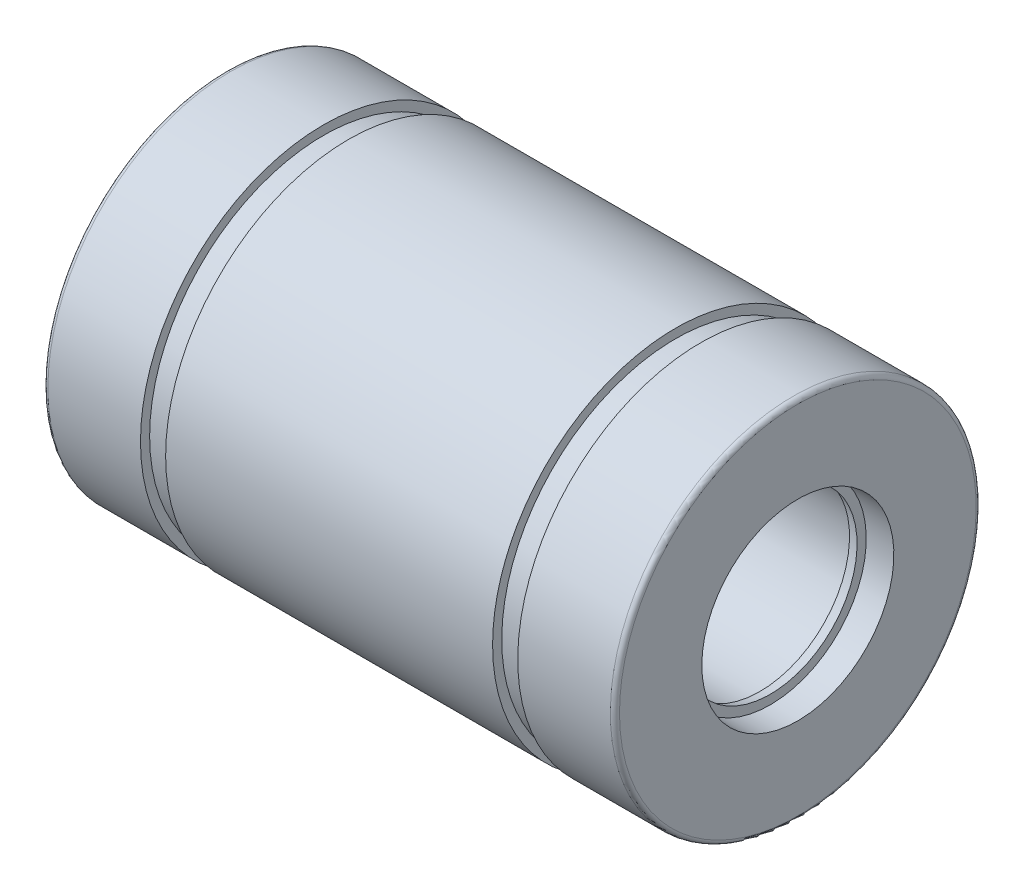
ISO-10303-21;
HEADER;
FILE_DESCRIPTION(('STEP AP214'),'2;1');
FILE_NAME('part.step','',(''),(''),'','','');
FILE_SCHEMA(('AUTOMOTIVE_DESIGN { 1 0 10303 214 1 1 1 1 }'));
ENDSEC;
DATA;
#1=APPLICATION_CONTEXT('core data for automotive mechanical design processes');
#2=APPLICATION_PROTOCOL_DEFINITION('international standard','automotive_design',2000,#1);
#3=PRODUCT_CONTEXT('',#1,'mechanical');
#4=PRODUCT('Part','Part','',(#3));
#5=PRODUCT_RELATED_PRODUCT_CATEGORY('part','',(#4));
#6=PRODUCT_DEFINITION_FORMATION('','',#4);
#7=PRODUCT_DEFINITION_CONTEXT('part definition',#1,'design');
#8=PRODUCT_DEFINITION('design','',#6,#7);
#9=PRODUCT_DEFINITION_SHAPE('','',#8);
#10=(LENGTH_UNIT() NAMED_UNIT(*) SI_UNIT(.MILLI.,.METRE.));
#11=(NAMED_UNIT(*) PLANE_ANGLE_UNIT() SI_UNIT($,.RADIAN.));
#12=(NAMED_UNIT(*) SI_UNIT($,.STERADIAN.) SOLID_ANGLE_UNIT());
#13=UNCERTAINTY_MEASURE_WITH_UNIT(LENGTH_MEASURE(1.E-05),#10,'distance_accuracy_value','');
#14=(GEOMETRIC_REPRESENTATION_CONTEXT(3) GLOBAL_UNCERTAINTY_ASSIGNED_CONTEXT((#13)) GLOBAL_UNIT_ASSIGNED_CONTEXT((#10,
#11,#12)) REPRESENTATION_CONTEXT('',''));
#15=CARTESIAN_POINT('',(0.,0.,0.));
#16=DIRECTION('',(0.,0.,1.));
#17=DIRECTION('',(1.,0.,0.));
#18=AXIS2_PLACEMENT_3D('',#15,#16,#17);
#19=CARTESIAN_POINT('',(0.,0.,-4.));
#20=DIRECTION('',(-1.,0.,0.));
#21=DIRECTION('',(0.,0.,1.));
#22=AXIS2_PLACEMENT_3D('',#19,#20,#21);
#23=PLANE('',#22);
#24=CARTESIAN_POINT('',(0.,0.,0.));
#25=DIRECTION('',(1.,0.,0.));
#26=DIRECTION('',(0.,0.,-1.));
#27=AXIS2_PLACEMENT_3D('',#24,#25,#26);
#28=CIRCLE('',#27,4.2);
#29=CARTESIAN_POINT('',(0.,0.,4.2));
#30=VERTEX_POINT('',#29);
#31=EDGE_CURVE('E217',#30,#30,#28,.T.);
#32=ORIENTED_EDGE('',*,*,#31,.T.);
#33=EDGE_LOOP('',(#32));
#34=FACE_BOUND('',#33,.T.);
#35=CARTESIAN_POINT('',(0.,0.,0.));
#36=DIRECTION('',(-1.,0.,0.));
#37=DIRECTION('',(0.,0.,1.));
#38=AXIS2_PLACEMENT_3D('',#35,#36,#37);
#39=CIRCLE('',#38,7.8);
#40=CARTESIAN_POINT('',(0.,0.,7.8));
#41=VERTEX_POINT('',#40);
#42=CARTESIAN_POINT('',(0.,7.8,0.));
#43=VERTEX_POINT('',#42);
#44=EDGE_CURVE('E362',#41,#43,#39,.T.);
#45=ORIENTED_EDGE('',*,*,#44,.T.);
#46=CARTESIAN_POINT('',(0.,0.,0.));
#47=DIRECTION('',(-1.,0.,0.));
#48=DIRECTION('',(0.,0.,1.));
#49=AXIS2_PLACEMENT_3D('',#46,#47,#48);
#50=CIRCLE('',#49,7.8);
#51=EDGE_CURVE('E364',#43,#41,#50,.T.);
#52=ORIENTED_EDGE('',*,*,#51,.T.);
#53=EDGE_LOOP('',(#45,#52));
#54=FACE_BOUND('',#53,.T.);
#55=ADVANCED_FACE('F16',(#34,#54),#23,.T.);
#56=CARTESIAN_POINT('',(5.35,0.,-7.8));
#57=DIRECTION('',(1.,0.,0.));
#58=DIRECTION('',(0.,1.,0.));
#59=AXIS2_PLACEMENT_3D('',#56,#57,#58);
#60=PLANE('',#59);
#61=CARTESIAN_POINT('',(5.35,0.,0.));
#62=DIRECTION('',(1.,0.,0.));
#63=DIRECTION('',(0.,0.,-1.));
#64=AXIS2_PLACEMENT_3D('',#61,#62,#63);
#65=CIRCLE('',#64,7.6);
#66=CARTESIAN_POINT('',(5.35,0.,7.6));
#67=VERTEX_POINT('',#66);
#68=EDGE_CURVE('E187',#67,#67,#65,.T.);
#69=ORIENTED_EDGE('',*,*,#68,.T.);
#70=EDGE_LOOP('',(#69));
#71=FACE_BOUND('',#70,.T.);
#72=CARTESIAN_POINT('',(5.35,0.,0.));
#73=DIRECTION('',(1.,0.,0.));
#74=DIRECTION('',(0.,0.,-1.));
#75=AXIS2_PLACEMENT_3D('',#72,#73,#74);
#76=CIRCLE('',#75,8.);
#77=CARTESIAN_POINT('',(5.35,0.,8.));
#78=VERTEX_POINT('',#77);
#79=EDGE_CURVE('E401',#78,#78,#76,.T.);
#80=ORIENTED_EDGE('',*,*,#79,.F.);
#81=EDGE_LOOP('',(#80));
#82=FACE_BOUND('',#81,.T.);
#83=ADVANCED_FACE('F188',(#71,#82),#60,.F.);
#84=CARTESIAN_POINT('',(4.25,0.,-7.8));
#85=DIRECTION('',(-1.,0.,0.));
#86=DIRECTION('',(0.,0.,1.));
#87=AXIS2_PLACEMENT_3D('',#84,#85,#86);
#88=PLANE('',#87);
#89=CARTESIAN_POINT('',(4.25,0.,0.));
#90=DIRECTION('',(1.,0.,0.));
#91=DIRECTION('',(0.,0.,-1.));
#92=AXIS2_PLACEMENT_3D('',#89,#90,#91);
#93=CIRCLE('',#92,7.6);
#94=CARTESIAN_POINT('',(4.25,0.,7.6));
#95=VERTEX_POINT('',#94);
#96=EDGE_CURVE('E204',#95,#95,#93,.T.);
#97=ORIENTED_EDGE('',*,*,#96,.F.);
#98=EDGE_LOOP('',(#97));
#99=FACE_BOUND('',#98,.T.);
#100=CARTESIAN_POINT('',(4.25,0.,0.));
#101=DIRECTION('',(-1.,0.,0.));
#102=DIRECTION('',(0.,0.,-1.));
#103=AXIS2_PLACEMENT_3D('',#100,#101,#102);
#104=CIRCLE('',#103,8.);
#105=CARTESIAN_POINT('',(4.25,0.,8.));
#106=VERTEX_POINT('',#105);
#107=EDGE_CURVE('E375',#106,#106,#104,.T.);
#108=ORIENTED_EDGE('',*,*,#107,.F.);
#109=EDGE_LOOP('',(#108));
#110=FACE_BOUND('',#109,.T.);
#111=ADVANCED_FACE('F357',(#99,#110),#88,.F.);
#112=CARTESIAN_POINT('',(1.208,0.,-4.4));
#113=DIRECTION('',(-1.,0.,0.));
#114=DIRECTION('',(0.,0.,1.));
#115=AXIS2_PLACEMENT_3D('',#112,#113,#114);
#116=PLANE('',#115);
#117=CARTESIAN_POINT('',(1.208,0.,0.));
#118=DIRECTION('',(1.,0.,0.));
#119=DIRECTION('',(0.,0.,-1.));
#120=AXIS2_PLACEMENT_3D('',#117,#118,#119);
#121=CIRCLE('',#120,4.2);
#122=CARTESIAN_POINT('',(1.208,0.,4.2));
#123=VERTEX_POINT('',#122);
#124=EDGE_CURVE('E193',#123,#123,#121,.T.);
#125=ORIENTED_EDGE('',*,*,#124,.F.);
#126=EDGE_LOOP('',(#125));
#127=FACE_BOUND('',#126,.T.);
#128=CARTESIAN_POINT('',(1.208,0.,0.));
#129=DIRECTION('',(1.,0.,0.));
#130=DIRECTION('',(0.,0.,-1.));
#131=AXIS2_PLACEMENT_3D('',#128,#129,#130);
#132=CIRCLE('',#131,4.8);
#133=CARTESIAN_POINT('',(1.208,0.,4.8));
#134=VERTEX_POINT('',#133);
#135=EDGE_CURVE('E228',#134,#134,#132,.T.);
#136=ORIENTED_EDGE('',*,*,#135,.T.);
#137=EDGE_LOOP('',(#136));
#138=FACE_BOUND('',#137,.T.);
#139=ADVANCED_FACE('F431',(#127,#138),#116,.F.);
#140=CARTESIAN_POINT('',(1.661,0.,-4.4));
#141=DIRECTION('',(1.,0.,0.));
#142=DIRECTION('',(0.,1.,0.));
#143=AXIS2_PLACEMENT_3D('',#140,#141,#142);
#144=PLANE('',#143);
#145=CARTESIAN_POINT('',(1.661,0.,0.));
#146=DIRECTION('',(-1.,0.,0.));
#147=DIRECTION('',(0.,0.,-1.));
#148=AXIS2_PLACEMENT_3D('',#145,#146,#147);
#149=CIRCLE('',#148,4.);
#150=CARTESIAN_POINT('',(1.661,0.,4.));
#151=VERTEX_POINT('',#150);
#152=EDGE_CURVE('E388',#151,#151,#149,.T.);
#153=ORIENTED_EDGE('',*,*,#152,.F.);
#154=EDGE_LOOP('',(#153));
#155=FACE_BOUND('',#154,.T.);
#156=CARTESIAN_POINT('',(1.661,0.,0.));
#157=DIRECTION('',(1.,0.,0.));
#158=DIRECTION('',(0.,0.,-1.));
#159=AXIS2_PLACEMENT_3D('',#156,#157,#158);
#160=CIRCLE('',#159,4.8);
#161=CARTESIAN_POINT('',(1.661,0.,4.8));
#162=VERTEX_POINT('',#161);
#163=EDGE_CURVE('E290',#162,#162,#160,.T.);
#164=ORIENTED_EDGE('',*,*,#163,.F.);
#165=EDGE_LOOP('',(#164));
#166=FACE_BOUND('',#165,.T.);
#167=ADVANCED_FACE('F816',(#155,#166),#144,.F.);
#168=CARTESIAN_POINT('',(25.,2.,3.46410161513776));
#169=DIRECTION('',(1.,0.,0.));
#170=DIRECTION('',(0.,-1.,0.));
#171=AXIS2_PLACEMENT_3D('',#168,#169,#170);
#172=PLANE('',#171);
#173=CARTESIAN_POINT('',(25.,0.,0.));
#174=DIRECTION('',(-1.,0.,0.));
#175=DIRECTION('',(0.,0.5,0.866025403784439));
#176=AXIS2_PLACEMENT_3D('',#173,#174,#175);
#177=CIRCLE('',#176,4.2);
#178=CARTESIAN_POINT('',(25.,-2.1,-3.63730669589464));
#179=VERTEX_POINT('',#178);
#180=EDGE_CURVE('E276',#179,#179,#177,.T.);
#181=ORIENTED_EDGE('',*,*,#180,.T.);
#182=EDGE_LOOP('',(#181));
#183=FACE_BOUND('',#182,.T.);
#184=CARTESIAN_POINT('',(25.,0.,0.));
#185=DIRECTION('',(1.,0.,0.));
#186=DIRECTION('',(0.,0.,-1.));
#187=AXIS2_PLACEMENT_3D('',#184,#185,#186);
#188=CIRCLE('',#187,7.8);
#189=CARTESIAN_POINT('',(25.,-3.9,-6.75499814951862));
#190=VERTEX_POINT('',#189);
#191=CARTESIAN_POINT('',(25.,6.75499814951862,-3.9));
#192=VERTEX_POINT('',#191);
#193=EDGE_CURVE('E249',#190,#192,#188,.T.);
#194=ORIENTED_EDGE('',*,*,#193,.T.);
#195=CARTESIAN_POINT('',(25.,0.,0.));
#196=DIRECTION('',(1.,0.,0.));
#197=DIRECTION('',(0.,0.,-1.));
#198=AXIS2_PLACEMENT_3D('',#195,#196,#197);
#199=CIRCLE('',#198,7.8);
#200=EDGE_CURVE('E253',#192,#190,#199,.T.);
#201=ORIENTED_EDGE('',*,*,#200,.T.);
#202=EDGE_LOOP('',(#194,#201));
#203=FACE_BOUND('',#202,.T.);
#204=ADVANCED_FACE('F811',(#183,#203),#172,.T.);
#205=CARTESIAN_POINT('',(19.65,3.9,6.75499814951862));
#206=DIRECTION('',(-1.,0.,0.));
#207=DIRECTION('',(0.,0.,1.));
#208=AXIS2_PLACEMENT_3D('',#205,#206,#207);
#209=PLANE('',#208);
#210=CARTESIAN_POINT('',(19.65,0.,0.));
#211=DIRECTION('',(-1.,0.,0.));
#212=DIRECTION('',(0.,0.5,0.866025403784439));
#213=AXIS2_PLACEMENT_3D('',#210,#211,#212);
#214=CIRCLE('',#213,7.6);
#215=CARTESIAN_POINT('',(19.65,-3.8,-6.58179306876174));
#216=VERTEX_POINT('',#215);
#217=EDGE_CURVE('E265',#216,#216,#214,.T.);
#218=ORIENTED_EDGE('',*,*,#217,.T.);
#219=EDGE_LOOP('',(#218));
#220=FACE_BOUND('',#219,.T.);
#221=CARTESIAN_POINT('',(19.65,0.,0.));
#222=DIRECTION('',(-1.,0.,0.));
#223=DIRECTION('',(0.,0.5,0.866025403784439));
#224=AXIS2_PLACEMENT_3D('',#221,#222,#223);
#225=CIRCLE('',#224,8.);
#226=CARTESIAN_POINT('',(19.65,4.,6.92820323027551));
#227=VERTEX_POINT('',#226);
#228=CARTESIAN_POINT('',(19.65,0.,8.));
#229=VERTEX_POINT('',#228);
#230=EDGE_CURVE('E415',#227,#229,#225,.T.);
#231=ORIENTED_EDGE('',*,*,#230,.F.);
#232=CARTESIAN_POINT('',(19.65,0.,0.));
#233=DIRECTION('',(-1.,0.,0.));
#234=DIRECTION('',(0.,0.5,0.866025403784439));
#235=AXIS2_PLACEMENT_3D('',#232,#233,#234);
#236=CIRCLE('',#235,8.);
#237=EDGE_CURVE('E411',#229,#227,#236,.T.);
#238=ORIENTED_EDGE('',*,*,#237,.F.);
#239=EDGE_LOOP('',(#231,#238));
#240=FACE_BOUND('',#239,.T.);
#241=ADVANCED_FACE('F348',(#220,#240),#209,.F.);
#242=CARTESIAN_POINT('',(20.75,3.9,6.75499814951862));
#243=DIRECTION('',(1.,0.,0.));
#244=DIRECTION('',(0.,-1.,0.));
#245=AXIS2_PLACEMENT_3D('',#242,#243,#244);
#246=PLANE('',#245);
#247=CARTESIAN_POINT('',(20.75,0.,0.));
#248=DIRECTION('',(-1.,0.,0.));
#249=DIRECTION('',(0.,0.5,0.866025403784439));
#250=AXIS2_PLACEMENT_3D('',#247,#248,#249);
#251=CIRCLE('',#250,7.6);
#252=CARTESIAN_POINT('',(20.75,-3.8,-6.58179306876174));
#253=VERTEX_POINT('',#252);
#254=EDGE_CURVE('E257',#253,#253,#251,.T.);
#255=ORIENTED_EDGE('',*,*,#254,.F.);
#256=EDGE_LOOP('',(#255));
#257=FACE_BOUND('',#256,.T.);
#258=CARTESIAN_POINT('',(20.75,0.,0.));
#259=DIRECTION('',(1.,0.,0.));
#260=DIRECTION('',(0.,0.5,0.866025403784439));
#261=AXIS2_PLACEMENT_3D('',#258,#259,#260);
#262=CIRCLE('',#261,8.);
#263=CARTESIAN_POINT('',(20.75,-4.,-6.92820323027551));
#264=VERTEX_POINT('',#263);
#265=EDGE_CURVE('E240',#264,#264,#262,.T.);
#266=ORIENTED_EDGE('',*,*,#265,.F.);
#267=EDGE_LOOP('',(#266));
#268=FACE_BOUND('',#267,.T.);
#269=ADVANCED_FACE('F337',(#257,#268),#246,.F.);
#270=CARTESIAN_POINT('',(23.792,2.2,3.81051177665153));
#271=DIRECTION('',(1.,0.,0.));
#272=DIRECTION('',(0.,-1.,0.));
#273=AXIS2_PLACEMENT_3D('',#270,#271,#272);
#274=PLANE('',#273);
#275=CARTESIAN_POINT('',(23.792,0.,0.));
#276=DIRECTION('',(-1.,0.,0.));
#277=DIRECTION('',(0.,0.5,0.866025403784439));
#278=AXIS2_PLACEMENT_3D('',#275,#276,#277);
#279=CIRCLE('',#278,4.2);
#280=CARTESIAN_POINT('',(23.792,-2.1,-3.63730669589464));
#281=VERTEX_POINT('',#280);
#282=EDGE_CURVE('E268',#281,#281,#279,.T.);
#283=ORIENTED_EDGE('',*,*,#282,.F.);
#284=EDGE_LOOP('',(#283));
#285=FACE_BOUND('',#284,.T.);
#286=CARTESIAN_POINT('',(23.792,0.,0.));
#287=DIRECTION('',(-1.,0.,0.));
#288=DIRECTION('',(0.,0.5,0.866025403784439));
#289=AXIS2_PLACEMENT_3D('',#286,#287,#288);
#290=CIRCLE('',#289,4.8);
#291=CARTESIAN_POINT('',(23.792,-2.4,-4.15692193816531));
#292=VERTEX_POINT('',#291);
#293=EDGE_CURVE('E287',#292,#292,#290,.T.);
#294=ORIENTED_EDGE('',*,*,#293,.T.);
#295=EDGE_LOOP('',(#294));
#296=FACE_BOUND('',#295,.T.);
#297=ADVANCED_FACE('F334',(#285,#296),#274,.F.);
#298=CARTESIAN_POINT('',(23.339,2.2,3.81051177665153));
#299=DIRECTION('',(-1.,0.,0.));
#300=DIRECTION('',(0.,0.,1.));
#301=AXIS2_PLACEMENT_3D('',#298,#299,#300);
#302=PLANE('',#301);
#303=CARTESIAN_POINT('',(23.339,0.,0.));
#304=DIRECTION('',(1.,0.,0.));
#305=DIRECTION('',(0.,0.5,0.866025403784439));
#306=AXIS2_PLACEMENT_3D('',#303,#304,#305);
#307=CIRCLE('',#306,4.);
#308=CARTESIAN_POINT('',(23.339,2.,3.46410161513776));
#309=VERTEX_POINT('',#308);
#310=CARTESIAN_POINT('',(23.339,0.,4.));
#311=VERTEX_POINT('',#310);
#312=EDGE_CURVE('E397',#309,#311,#307,.T.);
#313=ORIENTED_EDGE('',*,*,#312,.F.);
#314=CARTESIAN_POINT('',(23.339,0.,0.));
#315=DIRECTION('',(1.,0.,0.));
#316=DIRECTION('',(0.,0.5,0.866025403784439));
#317=AXIS2_PLACEMENT_3D('',#314,#315,#316);
#318=CIRCLE('',#317,4.);
#319=EDGE_CURVE('E390',#311,#309,#318,.T.);
#320=ORIENTED_EDGE('',*,*,#319,.F.);
#321=EDGE_LOOP('',(#313,#320));
#322=FACE_BOUND('',#321,.T.);
#323=CARTESIAN_POINT('',(23.339,0.,0.));
#324=DIRECTION('',(-1.,0.,0.));
#325=DIRECTION('',(0.,0.5,0.866025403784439));
#326=AXIS2_PLACEMENT_3D('',#323,#324,#325);
#327=CIRCLE('',#326,4.8);
#328=CARTESIAN_POINT('',(23.339,-2.4,-4.15692193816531));
#329=VERTEX_POINT('',#328);
#330=EDGE_CURVE('E208',#329,#329,#327,.T.);
#331=ORIENTED_EDGE('',*,*,#330,.F.);
#332=EDGE_LOOP('',(#331));
#333=FACE_BOUND('',#332,.T.);
#334=ADVANCED_FACE('F336',(#322,#333),#302,.F.);
#335=CARTESIAN_POINT('',(1.66,0.,-2.4024));
#336=DIRECTION('',(1.,0.,0.));
#337=DIRECTION('',(0.,1.,0.));
#338=AXIS2_PLACEMENT_3D('',#335,#336,#337);
#339=PLANE('',#338);
#340=CARTESIAN_POINT('',(1.66,0.,0.));
#341=DIRECTION('',(-1.,0.,0.));
#342=DIRECTION('',(0.,0.,-1.));
#343=AXIS2_PLACEMENT_3D('',#340,#341,#342);
#344=CIRCLE('',#343,3.92);
#345=CARTESIAN_POINT('',(1.66,0.,3.92));
#346=VERTEX_POINT('',#345);
#347=EDGE_CURVE('E212',#346,#346,#344,.T.);
#348=ORIENTED_EDGE('',*,*,#347,.T.);
#349=EDGE_LOOP('',(#348));
#350=FACE_BOUND('',#349,.T.);
#351=CARTESIAN_POINT('',(1.66,0.,0.));
#352=DIRECTION('',(-1.,0.,0.));
#353=DIRECTION('',(0.,0.,-1.));
#354=AXIS2_PLACEMENT_3D('',#351,#352,#353);
#355=CIRCLE('',#354,4.8);
#356=CARTESIAN_POINT('',(1.66,0.,4.8));
#357=VERTEX_POINT('',#356);
#358=EDGE_CURVE('E298',#357,#357,#355,.T.);
#359=ORIENTED_EDGE('',*,*,#358,.F.);
#360=EDGE_LOOP('',(#359));
#361=FACE_BOUND('',#360,.T.);
#362=ADVANCED_FACE('F345',(#350,#361),#339,.T.);
#363=CARTESIAN_POINT('',(1.209,0.,-2.4024));
#364=DIRECTION('',(-1.,0.,0.));
#365=DIRECTION('',(0.,0.,1.));
#366=AXIS2_PLACEMENT_3D('',#363,#364,#365);
#367=PLANE('',#366);
#368=CARTESIAN_POINT('',(1.209,0.,0.));
#369=DIRECTION('',(1.,0.,0.));
#370=DIRECTION('',(0.,0.,-1.));
#371=AXIS2_PLACEMENT_3D('',#368,#369,#370);
#372=CIRCLE('',#371,3.8);
#373=CARTESIAN_POINT('',(1.209,0.,3.8));
#374=VERTEX_POINT('',#373);
#375=EDGE_CURVE('E301',#374,#374,#372,.T.);
#376=ORIENTED_EDGE('',*,*,#375,.T.);
#377=EDGE_LOOP('',(#376));
#378=FACE_BOUND('',#377,.T.);
#379=CARTESIAN_POINT('',(1.209,0.,0.));
#380=DIRECTION('',(1.,0.,0.));
#381=DIRECTION('',(0.,0.,-1.));
#382=AXIS2_PLACEMENT_3D('',#379,#380,#381);
#383=CIRCLE('',#382,4.8);
#384=CARTESIAN_POINT('',(1.209,0.,4.8));
#385=VERTEX_POINT('',#384);
#386=EDGE_CURVE('E220',#385,#385,#383,.T.);
#387=ORIENTED_EDGE('',*,*,#386,.F.);
#388=EDGE_LOOP('',(#387));
#389=FACE_BOUND('',#388,.T.);
#390=ADVANCED_FACE('F792',(#378,#389),#367,.T.);
#391=CARTESIAN_POINT('',(23.34,1.2012,2.08053943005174));
#392=DIRECTION('',(-1.,0.,0.));
#393=DIRECTION('',(0.,0.,1.));
#394=AXIS2_PLACEMENT_3D('',#391,#392,#393);
#395=PLANE('',#394);
#396=CARTESIAN_POINT('',(23.34,0.,0.));
#397=DIRECTION('',(1.,0.,0.));
#398=DIRECTION('',(0.,0.5,0.866025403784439));
#399=AXIS2_PLACEMENT_3D('',#396,#397,#398);
#400=CIRCLE('',#399,3.92);
#401=CARTESIAN_POINT('',(23.34,-1.96,-3.394819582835));
#402=VERTEX_POINT('',#401);
#403=EDGE_CURVE('E10',#402,#402,#400,.T.);
#404=ORIENTED_EDGE('',*,*,#403,.T.);
#405=EDGE_LOOP('',(#404));
#406=FACE_BOUND('',#405,.T.);
#407=CARTESIAN_POINT('',(23.34,0.,0.));
#408=DIRECTION('',(1.,0.,0.));
#409=DIRECTION('',(0.,0.5,0.866025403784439));
#410=AXIS2_PLACEMENT_3D('',#407,#408,#409);
#411=CIRCLE('',#410,4.8);
#412=CARTESIAN_POINT('',(23.34,-2.4,-4.15692193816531));
#413=VERTEX_POINT('',#412);
#414=EDGE_CURVE('E314',#413,#413,#411,.T.);
#415=ORIENTED_EDGE('',*,*,#414,.F.);
#416=EDGE_LOOP('',(#415));
#417=FACE_BOUND('',#416,.T.);
#418=ADVANCED_FACE('F327',(#406,#417),#395,.T.);
#419=CARTESIAN_POINT('',(23.791,1.2012,2.08053943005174));
#420=DIRECTION('',(1.,0.,0.));
#421=DIRECTION('',(0.,-1.,0.));
#422=AXIS2_PLACEMENT_3D('',#419,#420,#421);
#423=PLANE('',#422);
#424=CARTESIAN_POINT('',(23.791,0.,0.));
#425=DIRECTION('',(-1.,0.,0.));
#426=DIRECTION('',(0.,0.5,0.866025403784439));
#427=AXIS2_PLACEMENT_3D('',#424,#425,#426);
#428=CIRCLE('',#427,3.8);
#429=CARTESIAN_POINT('',(23.791,-1.9,-3.29089653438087));
#430=VERTEX_POINT('',#429);
#431=EDGE_CURVE('E317',#430,#430,#428,.T.);
#432=ORIENTED_EDGE('',*,*,#431,.T.);
#433=EDGE_LOOP('',(#432));
#434=FACE_BOUND('',#433,.T.);
#435=CARTESIAN_POINT('',(23.791,0.,0.));
#436=DIRECTION('',(-1.,0.,0.));
#437=DIRECTION('',(0.,0.5,0.866025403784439));
#438=AXIS2_PLACEMENT_3D('',#435,#436,#437);
#439=CIRCLE('',#438,4.8);
#440=CARTESIAN_POINT('',(23.791,-2.4,-4.15692193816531));
#441=VERTEX_POINT('',#440);
#442=EDGE_CURVE('E279',#441,#441,#439,.T.);
#443=ORIENTED_EDGE('',*,*,#442,.F.);
#444=EDGE_LOOP('',(#443));
#445=FACE_BOUND('',#444,.T.);
#446=ADVANCED_FACE('F324',(#434,#445),#423,.T.);
#447=CARTESIAN_POINT('',(23.5655,0.,0.));
#448=DIRECTION('',(-1.,0.,0.));
#449=DIRECTION('',(0.,0.5,0.866025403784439));
#450=AXIS2_PLACEMENT_3D('',#447,#448,#449);
#451=CONICAL_SURFACE('',#450,3.86,0.260050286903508);
#452=ORIENTED_EDGE('',*,*,#431,.F.);
#453=DIRECTION('',(-0.966377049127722,-0.128564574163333,-0.222680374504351));
#454=VECTOR('',#453,1.);
#455=CARTESIAN_POINT('',(23.5655,-1.93,-3.34285805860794));
#456=LINE('',#455,#454);
#457=EDGE_CURVE('E24',#430,#402,#456,.T.);
#458=ORIENTED_EDGE('',*,*,#457,.T.);
#459=ORIENTED_EDGE('',*,*,#403,.F.);
#460=ORIENTED_EDGE('',*,*,#457,.F.);
#461=EDGE_LOOP('',(#452,#458,#459,#460));
#462=FACE_BOUND('',#461,.T.);
#463=ADVANCED_FACE('F322',(#462),#451,.F.);
#464=CARTESIAN_POINT('',(23.5655,0.,0.));
#465=DIRECTION('',(1.,0.,0.));
#466=DIRECTION('',(0.,0.5,0.866025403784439));
#467=AXIS2_PLACEMENT_3D('',#464,#465,#466);
#468=CYLINDRICAL_SURFACE('',#467,4.8);
#469=ORIENTED_EDGE('',*,*,#330,.T.);
#470=DIRECTION('',(1.,0.,0.));
#471=VECTOR('',#470,1.);
#472=CARTESIAN_POINT('',(23.5655,-2.4,-4.15692193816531));
#473=LINE('',#472,#471);
#474=EDGE_CURVE('E211',#329,#413,#473,.T.);
#475=ORIENTED_EDGE('',*,*,#474,.T.);
#476=ORIENTED_EDGE('',*,*,#414,.T.);
#477=ORIENTED_EDGE('',*,*,#474,.F.);
#478=EDGE_LOOP('',(#469,#475,#476,#477));
#479=FACE_BOUND('',#478,.T.);
#480=ADVANCED_FACE('F673',(#479),#468,.F.);
#481=CARTESIAN_POINT('',(1.4345,0.,0.));
#482=DIRECTION('',(1.,0.,0.));
#483=DIRECTION('',(0.,0.,-1.));
#484=AXIS2_PLACEMENT_3D('',#481,#482,#483);
#485=CONICAL_SURFACE('',#484,3.86,0.260050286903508);
#486=ORIENTED_EDGE('',*,*,#375,.F.);
#487=DIRECTION('',(0.966377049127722,0.,0.257129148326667));
#488=VECTOR('',#487,1.);
#489=CARTESIAN_POINT('',(1.4345,0.,3.86));
#490=LINE('',#489,#488);
#491=EDGE_CURVE('E305',#374,#346,#490,.T.);
#492=ORIENTED_EDGE('',*,*,#491,.T.);
#493=ORIENTED_EDGE('',*,*,#347,.F.);
#494=ORIENTED_EDGE('',*,*,#491,.F.);
#495=EDGE_LOOP('',(#486,#492,#493,#494));
#496=FACE_BOUND('',#495,.T.);
#497=ADVANCED_FACE('F678',(#496),#485,.F.);
#498=CARTESIAN_POINT('',(1.4345,0.,0.));
#499=DIRECTION('',(-1.,0.,0.));
#500=DIRECTION('',(0.,0.,-1.));
#501=AXIS2_PLACEMENT_3D('',#498,#499,#500);
#502=CYLINDRICAL_SURFACE('',#501,4.8);
#503=ORIENTED_EDGE('',*,*,#163,.T.);
#504=DIRECTION('',(-1.,0.,0.));
#505=VECTOR('',#504,1.);
#506=CARTESIAN_POINT('',(1.4345,0.,4.8));
#507=LINE('',#506,#505);
#508=EDGE_CURVE('E294',#162,#357,#507,.T.);
#509=ORIENTED_EDGE('',*,*,#508,.T.);
#510=ORIENTED_EDGE('',*,*,#358,.T.);
#511=ORIENTED_EDGE('',*,*,#508,.F.);
#512=EDGE_LOOP('',(#503,#509,#510,#511));
#513=FACE_BOUND('',#512,.T.);
#514=ADVANCED_FACE('F743',(#513),#502,.F.);
#515=CARTESIAN_POINT('',(23.5655,0.,0.));
#516=DIRECTION('',(1.,0.,0.));
#517=DIRECTION('',(0.,0.5,0.866025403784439));
#518=AXIS2_PLACEMENT_3D('',#515,#516,#517);
#519=CYLINDRICAL_SURFACE('',#518,4.8);
#520=ORIENTED_EDGE('',*,*,#442,.T.);
#521=DIRECTION('',(1.,0.,0.));
#522=VECTOR('',#521,1.);
#523=CARTESIAN_POINT('',(23.5655,-2.4,-4.15692193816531));
#524=LINE('',#523,#522);
#525=EDGE_CURVE('E283',#441,#292,#524,.T.);
#526=ORIENTED_EDGE('',*,*,#525,.T.);
#527=ORIENTED_EDGE('',*,*,#293,.F.);
#528=ORIENTED_EDGE('',*,*,#525,.F.);
#529=EDGE_LOOP('',(#520,#526,#527,#528));
#530=FACE_BOUND('',#529,.T.);
#531=ADVANCED_FACE('F331',(#530),#519,.F.);
#532=CARTESIAN_POINT('',(24.396,0.,0.));
#533=DIRECTION('',(1.,0.,0.));
#534=DIRECTION('',(0.,0.5,0.866025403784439));
#535=AXIS2_PLACEMENT_3D('',#532,#533,#534);
#536=CYLINDRICAL_SURFACE('',#535,4.2);
#537=ORIENTED_EDGE('',*,*,#282,.T.);
#538=DIRECTION('',(1.,0.,0.));
#539=VECTOR('',#538,1.);
#540=CARTESIAN_POINT('',(24.396,-2.1,-3.63730669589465));
#541=LINE('',#540,#539);
#542=EDGE_CURVE('E272',#281,#179,#541,.T.);
#543=ORIENTED_EDGE('',*,*,#542,.T.);
#544=ORIENTED_EDGE('',*,*,#180,.F.);
#545=ORIENTED_EDGE('',*,*,#542,.F.);
#546=EDGE_LOOP('',(#537,#543,#544,#545));
#547=FACE_BOUND('',#546,.T.);
#548=ADVANCED_FACE('F626',(#547),#536,.F.);
#549=CARTESIAN_POINT('',(20.475,0.,0.));
#550=DIRECTION('',(1.,0.,0.));
#551=DIRECTION('',(0.,0.5,0.866025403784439));
#552=AXIS2_PLACEMENT_3D('',#549,#550,#551);
#553=CYLINDRICAL_SURFACE('',#552,7.6);
#554=ORIENTED_EDGE('',*,*,#254,.T.);
#555=DIRECTION('',(-1.,0.,0.));
#556=VECTOR('',#555,1.);
#557=CARTESIAN_POINT('',(20.475,-3.8,-6.58179306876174));
#558=LINE('',#557,#556);
#559=EDGE_CURVE('E261',#253,#216,#558,.T.);
#560=ORIENTED_EDGE('',*,*,#559,.T.);
#561=ORIENTED_EDGE('',*,*,#217,.F.);
#562=ORIENTED_EDGE('',*,*,#559,.F.);
#563=EDGE_LOOP('',(#554,#560,#561,#562));
#564=FACE_BOUND('',#563,.T.);
#565=ADVANCED_FACE('F620',(#564),#553,.T.);
#566=CARTESIAN_POINT('',(24.8,0.,0.));
#567=DIRECTION('',(1.,0.,0.));
#568=DIRECTION('',(0.,-0.866025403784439,0.5));
#569=AXIS2_PLACEMENT_3D('',#566,#567,#568);
#570=TOROIDAL_SURFACE('',#569,7.8,0.2);
#571=ORIENTED_EDGE('',*,*,#193,.F.);
#572=ORIENTED_EDGE('',*,*,#200,.F.);
#573=CARTESIAN_POINT('',(24.8,6.75499814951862,-3.9));
#574=DIRECTION('',(0.,0.5,0.866025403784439));
#575=DIRECTION('',(0.,0.866025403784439,-0.5));
#576=AXIS2_PLACEMENT_3D('',#573,#574,#575);
#577=CIRCLE('',#576,0.2);
#578=CARTESIAN_POINT('',(24.8,6.92820323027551,-4.));
#579=VERTEX_POINT('',#578);
#580=EDGE_CURVE('E254',#192,#579,#577,.T.);
#581=ORIENTED_EDGE('',*,*,#580,.T.);
#582=CARTESIAN_POINT('',(24.8,0.,0.));
#583=DIRECTION('',(-1.,0.,0.));
#584=DIRECTION('',(0.,0.5,0.866025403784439));
#585=AXIS2_PLACEMENT_3D('',#582,#583,#584);
#586=CIRCLE('',#585,8.);
#587=CARTESIAN_POINT('',(24.8,-6.92820323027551,4.));
#588=VERTEX_POINT('',#587);
#589=EDGE_CURVE('E231',#588,#579,#586,.T.);
#590=ORIENTED_EDGE('',*,*,#589,.F.);
#591=CARTESIAN_POINT('',(24.8,0.,0.));
#592=DIRECTION('',(-1.,0.,0.));
#593=DIRECTION('',(0.,0.5,0.866025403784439));
#594=AXIS2_PLACEMENT_3D('',#591,#592,#593);
#595=CIRCLE('',#594,8.);
#596=CARTESIAN_POINT('',(24.8,-4.,-6.92820323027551));
#597=VERTEX_POINT('',#596);
#598=EDGE_CURVE('E246',#597,#588,#595,.T.);
#599=ORIENTED_EDGE('',*,*,#598,.F.);
#600=CARTESIAN_POINT('',(24.8,0.,0.));
#601=DIRECTION('',(-1.,0.,0.));
#602=DIRECTION('',(0.,0.5,0.866025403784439));
#603=AXIS2_PLACEMENT_3D('',#600,#601,#602);
#604=CIRCLE('',#603,8.);
#605=EDGE_CURVE('E235',#579,#597,#604,.T.);
#606=ORIENTED_EDGE('',*,*,#605,.F.);
#607=ORIENTED_EDGE('',*,*,#580,.F.);
#608=EDGE_LOOP('',(#571,#572,#581,#590,#599,#606,#607));
#609=FACE_BOUND('',#608,.T.);
#610=ADVANCED_FACE('F625',(#609),#570,.T.);
#611=CARTESIAN_POINT('',(21.225,0.,0.));
#612=DIRECTION('',(1.,0.,0.));
#613=DIRECTION('',(0.,0.5,0.866025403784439));
#614=AXIS2_PLACEMENT_3D('',#611,#612,#613);
#615=CYLINDRICAL_SURFACE('',#614,8.);
#616=ORIENTED_EDGE('',*,*,#589,.T.);
#617=ORIENTED_EDGE('',*,*,#605,.T.);
#618=DIRECTION('',(-1.,0.,0.));
#619=VECTOR('',#618,1.);
#620=CARTESIAN_POINT('',(21.225,-4.,-6.92820323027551));
#621=LINE('',#620,#619);
#622=EDGE_CURVE('E236',#597,#264,#621,.T.);
#623=ORIENTED_EDGE('',*,*,#622,.T.);
#624=ORIENTED_EDGE('',*,*,#265,.T.);
#625=ORIENTED_EDGE('',*,*,#622,.F.);
#626=ORIENTED_EDGE('',*,*,#598,.T.);
#627=EDGE_LOOP('',(#616,#617,#623,#624,#625,#626));
#628=FACE_BOUND('',#627,.T.);
#629=ADVANCED_FACE('F700',(#628),#615,.T.);
#630=CARTESIAN_POINT('',(1.4345,0.,0.));
#631=DIRECTION('',(-1.,0.,0.));
#632=DIRECTION('',(0.,0.,-1.));
#633=AXIS2_PLACEMENT_3D('',#630,#631,#632);
#634=CYLINDRICAL_SURFACE('',#633,4.8);
#635=ORIENTED_EDGE('',*,*,#386,.T.);
#636=DIRECTION('',(-1.,0.,0.));
#637=VECTOR('',#636,1.);
#638=CARTESIAN_POINT('',(1.4345,0.,4.8));
#639=LINE('',#638,#637);
#640=EDGE_CURVE('E224',#385,#134,#639,.T.);
#641=ORIENTED_EDGE('',*,*,#640,.T.);
#642=ORIENTED_EDGE('',*,*,#135,.F.);
#643=ORIENTED_EDGE('',*,*,#640,.F.);
#644=EDGE_LOOP('',(#635,#641,#642,#643));
#645=FACE_BOUND('',#644,.T.);
#646=ADVANCED_FACE('F653',(#645),#634,.F.);
#647=CARTESIAN_POINT('',(0.604,0.,0.));
#648=DIRECTION('',(-1.,0.,0.));
#649=DIRECTION('',(0.,0.,-1.));
#650=AXIS2_PLACEMENT_3D('',#647,#648,#649);
#651=CYLINDRICAL_SURFACE('',#650,4.2);
#652=ORIENTED_EDGE('',*,*,#124,.T.);
#653=DIRECTION('',(-1.,0.,0.));
#654=VECTOR('',#653,1.);
#655=CARTESIAN_POINT('',(0.604,0.,4.2));
#656=LINE('',#655,#654);
#657=EDGE_CURVE('E202',#123,#30,#656,.T.);
#658=ORIENTED_EDGE('',*,*,#657,.T.);
#659=ORIENTED_EDGE('',*,*,#31,.F.);
#660=ORIENTED_EDGE('',*,*,#657,.F.);
#661=EDGE_LOOP('',(#652,#658,#659,#660));
#662=FACE_BOUND('',#661,.T.);
#663=ADVANCED_FACE('F648',(#662),#651,.F.);
#664=CARTESIAN_POINT('',(4.525,0.,0.));
#665=DIRECTION('',(-1.,0.,0.));
#666=DIRECTION('',(0.,0.,-1.));
#667=AXIS2_PLACEMENT_3D('',#664,#665,#666);
#668=CYLINDRICAL_SURFACE('',#667,7.6);
#669=ORIENTED_EDGE('',*,*,#96,.T.);
#670=DIRECTION('',(1.,0.,0.));
#671=VECTOR('',#670,1.);
#672=CARTESIAN_POINT('',(4.525,0.,7.6));
#673=LINE('',#672,#671);
#674=EDGE_CURVE('E194',#95,#67,#673,.T.);
#675=ORIENTED_EDGE('',*,*,#674,.T.);
#676=ORIENTED_EDGE('',*,*,#68,.F.);
#677=ORIENTED_EDGE('',*,*,#674,.F.);
#678=EDGE_LOOP('',(#669,#675,#676,#677));
#679=FACE_BOUND('',#678,.T.);
#680=ADVANCED_FACE('F427',(#679),#668,.T.);
#681=CARTESIAN_POINT('',(3.775,0.,0.));
#682=DIRECTION('',(-1.,0.,0.));
#683=DIRECTION('',(0.,0.,-1.));
#684=AXIS2_PLACEMENT_3D('',#681,#682,#683);
#685=CYLINDRICAL_SURFACE('',#684,8.);
#686=ORIENTED_EDGE('',*,*,#79,.T.);
#687=DIRECTION('',(1.,0.,0.));
#688=VECTOR('',#687,1.);
#689=CARTESIAN_POINT('',(3.775,0.,8.));
#690=LINE('',#689,#688);
#691=EDGE_CURVE('E405',#78,#229,#690,.T.);
#692=ORIENTED_EDGE('',*,*,#691,.T.);
#693=ORIENTED_EDGE('',*,*,#237,.T.);
#694=ORIENTED_EDGE('',*,*,#230,.T.);
#695=ORIENTED_EDGE('',*,*,#691,.F.);
#696=EDGE_LOOP('',(#686,#692,#693,#694,#695));
#697=FACE_BOUND('',#696,.T.);
#698=ADVANCED_FACE('F639',(#697),#685,.T.);
#699=CARTESIAN_POINT('',(3.775,0.,0.));
#700=DIRECTION('',(-1.,0.,0.));
#701=DIRECTION('',(0.,0.,-1.));
#702=AXIS2_PLACEMENT_3D('',#699,#700,#701);
#703=CYLINDRICAL_SURFACE('',#702,4.);
#704=ORIENTED_EDGE('',*,*,#312,.T.);
#705=DIRECTION('',(-1.,0.,0.));
#706=VECTOR('',#705,1.);
#707=CARTESIAN_POINT('',(3.775,0.,4.));
#708=LINE('',#707,#706);
#709=EDGE_CURVE('E391',#311,#151,#708,.T.);
#710=ORIENTED_EDGE('',*,*,#709,.T.);
#711=ORIENTED_EDGE('',*,*,#152,.T.);
#712=ORIENTED_EDGE('',*,*,#709,.F.);
#713=ORIENTED_EDGE('',*,*,#319,.T.);
#714=EDGE_LOOP('',(#704,#710,#711,#712,#713));
#715=FACE_BOUND('',#714,.T.);
#716=ADVANCED_FACE('F612',(#715),#703,.F.);
#717=CARTESIAN_POINT('',(0.2,0.,0.));
#718=DIRECTION('',(-1.,0.,0.));
#719=DIRECTION('',(0.,-1.,0.));
#720=AXIS2_PLACEMENT_3D('',#717,#718,#719);
#721=TOROIDAL_SURFACE('',#720,7.8,0.2);
#722=ORIENTED_EDGE('',*,*,#44,.F.);
#723=ORIENTED_EDGE('',*,*,#51,.F.);
#724=CARTESIAN_POINT('',(0.2,7.8,0.));
#725=DIRECTION('',(0.,0.,-1.));
#726=DIRECTION('',(0.,1.,0.));
#727=AXIS2_PLACEMENT_3D('',#724,#725,#726);
#728=CIRCLE('',#727,0.2);
#729=CARTESIAN_POINT('',(0.2,8.,0.));
#730=VERTEX_POINT('',#729);
#731=EDGE_CURVE('E373',#43,#730,#728,.T.);
#732=ORIENTED_EDGE('',*,*,#731,.T.);
#733=CARTESIAN_POINT('',(0.2,0.,0.));
#734=DIRECTION('',(1.,0.,0.));
#735=DIRECTION('',(0.,0.,-1.));
#736=AXIS2_PLACEMENT_3D('',#733,#734,#735);
#737=CIRCLE('',#736,8.);
#738=CARTESIAN_POINT('',(0.2,-8.,0.));
#739=VERTEX_POINT('',#738);
#740=EDGE_CURVE('E379',#739,#730,#737,.T.);
#741=ORIENTED_EDGE('',*,*,#740,.F.);
#742=CARTESIAN_POINT('',(0.2,0.,0.));
#743=DIRECTION('',(1.,0.,0.));
#744=DIRECTION('',(0.,0.,-1.));
#745=AXIS2_PLACEMENT_3D('',#742,#743,#744);
#746=CIRCLE('',#745,8.);
#747=CARTESIAN_POINT('',(0.2,0.,8.));
#748=VERTEX_POINT('',#747);
#749=EDGE_CURVE('E367',#748,#739,#746,.T.);
#750=ORIENTED_EDGE('',*,*,#749,.F.);
#751=CARTESIAN_POINT('',(0.2,0.,0.));
#752=DIRECTION('',(1.,0.,0.));
#753=DIRECTION('',(0.,0.,-1.));
#754=AXIS2_PLACEMENT_3D('',#751,#752,#753);
#755=CIRCLE('',#754,8.);
#756=EDGE_CURVE('E380',#730,#748,#755,.T.);
#757=ORIENTED_EDGE('',*,*,#756,.F.);
#758=ORIENTED_EDGE('',*,*,#731,.F.);
#759=EDGE_LOOP('',(#722,#723,#732,#741,#750,#757,#758));
#760=FACE_BOUND('',#759,.T.);
#761=ADVANCED_FACE('F440',(#760),#721,.T.);
#762=CARTESIAN_POINT('',(3.775,0.,0.));
#763=DIRECTION('',(-1.,0.,0.));
#764=DIRECTION('',(0.,0.,-1.));
#765=AXIS2_PLACEMENT_3D('',#762,#763,#764);
#766=CYLINDRICAL_SURFACE('',#765,8.);
#767=ORIENTED_EDGE('',*,*,#740,.T.);
#768=ORIENTED_EDGE('',*,*,#756,.T.);
#769=DIRECTION('',(1.,0.,0.));
#770=VECTOR('',#769,1.);
#771=CARTESIAN_POINT('',(3.775,0.,8.));
#772=LINE('',#771,#770);
#773=EDGE_CURVE('E384',#748,#106,#772,.T.);
#774=ORIENTED_EDGE('',*,*,#773,.T.);
#775=ORIENTED_EDGE('',*,*,#107,.T.);
#776=ORIENTED_EDGE('',*,*,#773,.F.);
#777=ORIENTED_EDGE('',*,*,#749,.T.);
#778=EDGE_LOOP('',(#767,#768,#774,#775,#776,#777));
#779=FACE_BOUND('',#778,.T.);
#780=ADVANCED_FACE('F437',(#779),#766,.T.);
#781=CLOSED_SHELL('',(#55,#83,#111,#139,#167,#204,#241,#269,#297,#334,#362,#390,#418,#446,#463,
#480,#497,#514,#531,#548,#565,#610,#629,#646,#663,#680,#698,#716,#761,#780));
#782=MANIFOLD_SOLID_BREP('B1',#781);
#783=ADVANCED_BREP_SHAPE_REPRESENTATION('',(#18,#782),#14);
#784=SHAPE_DEFINITION_REPRESENTATION(#9,#783);
ENDSEC;
END-ISO-10303-21;
